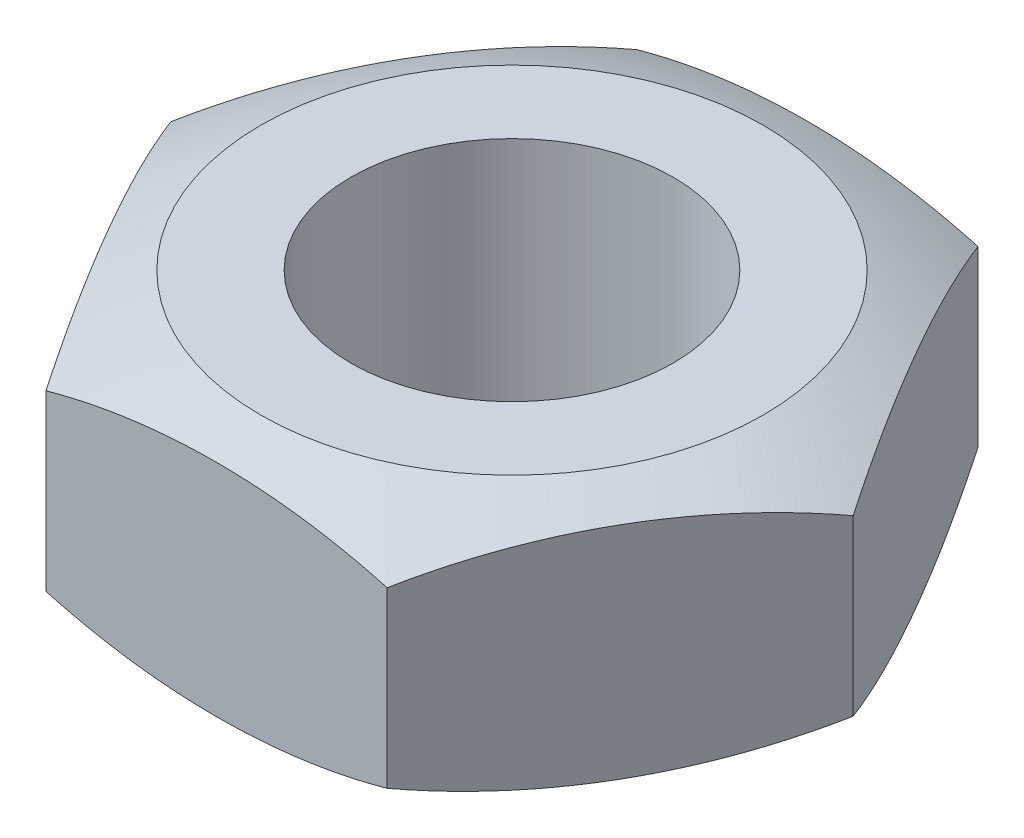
from build123d import *

# Parameters (mm, degrees)
BODY_DEPTH = 2.4
THREAD_R   = 1.5
HOLE_DEPTH = 5.837957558


with BuildPart() as part:
    # profile → body (new body)
    with BuildSketch(Plane(origin=(0, 0, 0), x_dir=(1, 0, 0), z_dir=(0, 1, 0))):
        Polygon((3.175426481, 0), (1.58771324, 2.75), (-1.58771324, 2.75), (-3.175426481, 0), (-1.58771324, -2.75), (1.58771324, -2.75), align=None)
    extrude(amount=BODY_DEPTH)

    # thread (on Top Plane) → hole (cut, through all)
    with BuildSketch(Plane(origin=(0, 0, 0), x_dir=(1, 0, 0), z_dir=(0, 1, 0))):
        with Locations(Location((0, 0, 0), (0, 0, 270))):
            Circle(THREAD_R)
    extrude(amount=HOLE_DEPTH, mode=Mode.SUBTRACT)

    # fillet_sketch → fillet 2 (revolve, cut)
    with BuildSketch(Plane.XY):
        with BuildLine():
            Line((3.175426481, 2.008777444), (3.175426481, 0.391222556))
            ThreePointArc((3.175426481, 0.391222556), (1.640291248, -0.223382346), (0, -0.432724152))
            Line((0, -0.432724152), (0, -3.698172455))
            Line((0, -3.698172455), (6.440874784, -3.698172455))
            Line((6.440874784, -3.698172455), (6.440874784, 6.098172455))
            Line((6.440874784, 6.098172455), (0, 6.098172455))
            Line((0, 6.098172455), (0, 2.832724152))
            ThreePointArc((0, 2.832724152), (1.640291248, 2.623382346), (3.175426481, 2.008777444))
        make_face()
    revolve(axis=Axis((0, -0.432724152, 0), (0, 1, 0)), mode=Mode.SUBTRACT)


solid = part.part
